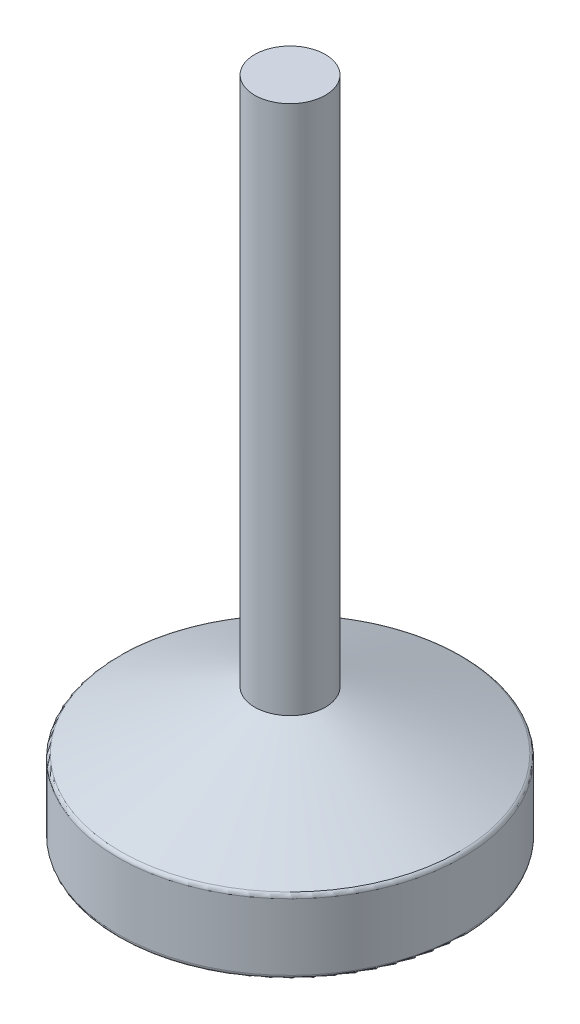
ISO-10303-21;
HEADER;
FILE_DESCRIPTION(('STEP AP214'),'2;1');
FILE_NAME('part.step','',(''),(''),'','','');
FILE_SCHEMA(('AUTOMOTIVE_DESIGN { 1 0 10303 214 1 1 1 1 }'));
ENDSEC;
DATA;
#1=APPLICATION_CONTEXT('core data for automotive mechanical design processes');
#2=APPLICATION_PROTOCOL_DEFINITION('international standard','automotive_design',2000,#1);
#3=PRODUCT_CONTEXT('',#1,'mechanical');
#4=PRODUCT('Part','Part','',(#3));
#5=PRODUCT_RELATED_PRODUCT_CATEGORY('part','',(#4));
#6=PRODUCT_DEFINITION_FORMATION('','',#4);
#7=PRODUCT_DEFINITION_CONTEXT('part definition',#1,'design');
#8=PRODUCT_DEFINITION('design','',#6,#7);
#9=PRODUCT_DEFINITION_SHAPE('','',#8);
#10=(LENGTH_UNIT() NAMED_UNIT(*) SI_UNIT(.MILLI.,.METRE.));
#11=(NAMED_UNIT(*) PLANE_ANGLE_UNIT() SI_UNIT($,.RADIAN.));
#12=(NAMED_UNIT(*) SI_UNIT($,.STERADIAN.) SOLID_ANGLE_UNIT());
#13=UNCERTAINTY_MEASURE_WITH_UNIT(LENGTH_MEASURE(1.E-05),#10,'distance_accuracy_value','');
#14=(GEOMETRIC_REPRESENTATION_CONTEXT(3) GLOBAL_UNCERTAINTY_ASSIGNED_CONTEXT((#13)) GLOBAL_UNIT_ASSIGNED_CONTEXT((#10,
#11,#12)) REPRESENTATION_CONTEXT('',''));
#15=CARTESIAN_POINT('',(0.,0.,0.));
#16=DIRECTION('',(0.,0.,1.));
#17=DIRECTION('',(1.,0.,0.));
#18=AXIS2_PLACEMENT_3D('',#15,#16,#17);
#19=CARTESIAN_POINT('',(8.00000000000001,0.,0.));
#20=DIRECTION('',(0.,-1.,0.));
#21=DIRECTION('',(0.,0.,-1.));
#22=AXIS2_PLACEMENT_3D('',#19,#20,#21);
#23=PLANE('',#22);
#24=CARTESIAN_POINT('',(0.,0.,0.));
#25=DIRECTION('',(0.,1.,0.));
#26=DIRECTION('',(0.,0.,1.));
#27=AXIS2_PLACEMENT_3D('',#24,#25,#26);
#28=CIRCLE('',#27,8.00000000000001);
#29=CARTESIAN_POINT('',(0.,0.,8.00000000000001));
#30=VERTEX_POINT('',#29);
#31=EDGE_CURVE('E54',#30,#30,#28,.T.);
#32=ORIENTED_EDGE('',*,*,#31,.T.);
#33=EDGE_LOOP('',(#32));
#34=FACE_BOUND('',#33,.T.);
#35=ADVANCED_FACE('F32',(#34),#23,.F.);
#36=CARTESIAN_POINT('',(0.,-150.,0.));
#37=DIRECTION('',(0.,1.,0.));
#38=DIRECTION('',(0.,0.,1.));
#39=AXIS2_PLACEMENT_3D('',#36,#37,#38);
#40=PLANE('',#39);
#41=CARTESIAN_POINT('',(0.,-150.,0.));
#42=DIRECTION('',(0.,1.,0.));
#43=DIRECTION('',(0.,0.,1.));
#44=AXIS2_PLACEMENT_3D('',#41,#42,#43);
#45=CIRCLE('',#44,37.9995484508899);
#46=CARTESIAN_POINT('',(0.,-150.,37.9995484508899));
#47=VERTEX_POINT('',#46);
#48=EDGE_CURVE('E10',#47,#47,#45,.T.);
#49=ORIENTED_EDGE('',*,*,#48,.F.);
#50=EDGE_LOOP('',(#49));
#51=FACE_BOUND('',#50,.T.);
#52=ADVANCED_FACE('F84',(#51),#40,.F.);
#53=CARTESIAN_POINT('',(0.,-149.,0.));
#54=DIRECTION('',(0.,1.,0.));
#55=DIRECTION('',(0.,0.,1.));
#56=AXIS2_PLACEMENT_3D('',#53,#54,#55);
#57=TOROIDAL_SURFACE('',#56,37.9995484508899,1.);
#58=CARTESIAN_POINT('',(0.,-149.,0.));
#59=DIRECTION('',(0.,1.,0.));
#60=DIRECTION('',(0.,0.,1.));
#61=AXIS2_PLACEMENT_3D('',#58,#59,#60);
#62=CIRCLE('',#61,38.9995484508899);
#63=CARTESIAN_POINT('',(0.,-149.,38.9995484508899));
#64=VERTEX_POINT('',#63);
#65=EDGE_CURVE('E38',#64,#64,#62,.T.);
#66=ORIENTED_EDGE('',*,*,#65,.F.);
#67=EDGE_LOOP('',(#66));
#68=FACE_BOUND('',#67,.T.);
#69=ORIENTED_EDGE('',*,*,#48,.T.);
#70=EDGE_LOOP('',(#69));
#71=FACE_BOUND('',#70,.T.);
#72=ADVANCED_FACE('F79',(#68,#71),#57,.T.);
#73=CARTESIAN_POINT('',(0.,10.3605900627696,0.));
#74=DIRECTION('',(0.,1.,0.));
#75=DIRECTION('',(0.,0.,1.));
#76=AXIS2_PLACEMENT_3D('',#73,#74,#75);
#77=CYLINDRICAL_SURFACE('',#76,38.9995484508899);
#78=CARTESIAN_POINT('',(0.,-134.,0.));
#79=DIRECTION('',(0.,1.,0.));
#80=DIRECTION('',(0.,0.,1.));
#81=AXIS2_PLACEMENT_3D('',#78,#79,#80);
#82=CIRCLE('',#81,38.9995484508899);
#83=CARTESIAN_POINT('',(0.,-134.,38.9995484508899));
#84=VERTEX_POINT('',#83);
#85=EDGE_CURVE('E42',#84,#84,#82,.T.);
#86=ORIENTED_EDGE('',*,*,#85,.F.);
#87=EDGE_LOOP('',(#86));
#88=FACE_BOUND('',#87,.T.);
#89=ORIENTED_EDGE('',*,*,#65,.T.);
#90=EDGE_LOOP('',(#89));
#91=FACE_BOUND('',#90,.T.);
#92=ADVANCED_FACE('F74',(#88,#91),#77,.T.);
#93=CARTESIAN_POINT('',(0.,-134.,0.));
#94=DIRECTION('',(0.,1.,0.));
#95=DIRECTION('',(0.,0.,1.));
#96=AXIS2_PLACEMENT_3D('',#93,#94,#95);
#97=TOROIDAL_SURFACE('',#96,37.9995484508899,1.00000000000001);
#98=CARTESIAN_POINT('',(0.,-133.08145876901,0.));
#99=DIRECTION('',(0.,1.,0.));
#100=DIRECTION('',(0.,0.,1.));
#101=AXIS2_PLACEMENT_3D('',#98,#99,#100);
#102=CIRCLE('',#101,38.3948736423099);
#103=CARTESIAN_POINT('',(0.,-133.08145876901,-38.3948736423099));
#104=VERTEX_POINT('',#103);
#105=EDGE_CURVE('E46',#104,#104,#102,.T.);
#106=ORIENTED_EDGE('',*,*,#105,.F.);
#107=EDGE_LOOP('',(#106));
#108=FACE_BOUND('',#107,.T.);
#109=ORIENTED_EDGE('',*,*,#85,.T.);
#110=EDGE_LOOP('',(#109));
#111=FACE_BOUND('',#110,.T.);
#112=ADVANCED_FACE('F68',(#108,#111),#97,.T.);
#113=CARTESIAN_POINT('',(0.,-133.08145876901,0.));
#114=DIRECTION('',(0.,-1.,0.));
#115=DIRECTION('',(0.,0.,-1.));
#116=AXIS2_PLACEMENT_3D('',#113,#114,#115);
#117=CONICAL_SURFACE('',#116,38.3948736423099,1.16437447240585);
#118=CARTESIAN_POINT('',(0.,-120.,0.));
#119=DIRECTION('',(0.,1.,0.));
#120=DIRECTION('',(0.,0.,1.));
#121=AXIS2_PLACEMENT_3D('',#118,#119,#120);
#122=CIRCLE('',#121,8.00000000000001);
#123=CARTESIAN_POINT('',(0.,-120.,-8.00000000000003));
#124=VERTEX_POINT('',#123);
#125=EDGE_CURVE('E51',#124,#124,#122,.T.);
#126=CARTESIAN_POINT('',(0.,-120.,-8.00000000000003));
#127=CARTESIAN_POINT('',(0.,-120.136265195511,-8.31661326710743));
#128=CARTESIAN_POINT('',(0.,-120.272530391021,-8.63322653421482));
#129=CARTESIAN_POINT('',(0.,-120.545060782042,-9.26645306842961));
#130=CARTESIAN_POINT('',(0.,-120.681325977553,-9.583066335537));
#131=CARTESIAN_POINT('',(0.,-120.953856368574,-10.2162928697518));
#132=CARTESIAN_POINT('',(0.,-121.090121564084,-10.5329061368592));
#133=CARTESIAN_POINT('',(0.,-121.362651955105,-11.166132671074));
#134=CARTESIAN_POINT('',(0.,-121.498917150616,-11.4827459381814));
#135=CARTESIAN_POINT('',(0.,-121.771447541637,-12.1159724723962));
#136=CARTESIAN_POINT('',(0.,-121.907712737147,-12.4325857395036));
#137=CARTESIAN_POINT('',(0.,-122.180243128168,-13.0658122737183));
#138=CARTESIAN_POINT('',(0.,-122.316508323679,-13.3824255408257));
#139=CARTESIAN_POINT('',(0.,-122.5890387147,-14.0156520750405));
#140=CARTESIAN_POINT('',(0.,-122.72530391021,-14.3322653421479));
#141=CARTESIAN_POINT('',(0.,-122.997834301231,-14.9654918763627));
#142=CARTESIAN_POINT('',(0.,-123.134099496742,-15.2821051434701));
#143=CARTESIAN_POINT('',(0.,-123.406629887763,-15.9153316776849));
#144=CARTESIAN_POINT('',(0.,-123.542895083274,-16.2319449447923));
#145=CARTESIAN_POINT('',(0.,-123.815425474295,-16.8651714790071));
#146=CARTESIAN_POINT('',(0.,-123.951690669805,-17.1817847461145));
#147=CARTESIAN_POINT('',(0.,-124.224221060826,-17.8150112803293));
#148=CARTESIAN_POINT('',(0.,-124.360486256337,-18.1316245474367));
#149=CARTESIAN_POINT('',(0.,-124.633016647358,-18.7648510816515));
#150=CARTESIAN_POINT('',(0.,-124.769281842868,-19.0814643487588));
#151=CARTESIAN_POINT('',(0.,-125.041812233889,-19.7146908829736));
#152=CARTESIAN_POINT('',(0.,-125.1780774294,-20.031304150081));
#153=CARTESIAN_POINT('',(0.,-125.450607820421,-20.6645306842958));
#154=CARTESIAN_POINT('',(0.,-125.586873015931,-20.9811439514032));
#155=CARTESIAN_POINT('',(0.,-125.859403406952,-21.614370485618));
#156=CARTESIAN_POINT('',(0.,-125.995668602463,-21.9309837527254));
#157=CARTESIAN_POINT('',(0.,-126.268198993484,-22.5642102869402));
#158=CARTESIAN_POINT('',(0.,-126.404464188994,-22.8808235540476));
#159=CARTESIAN_POINT('',(0.,-126.676994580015,-23.5140500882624));
#160=CARTESIAN_POINT('',(0.,-126.813259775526,-23.8306633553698));
#161=CARTESIAN_POINT('',(0.,-127.085790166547,-24.4638898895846));
#162=CARTESIAN_POINT('',(0.,-127.222055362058,-24.7805031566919));
#163=CARTESIAN_POINT('',(0.,-127.494585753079,-25.4137296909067));
#164=CARTESIAN_POINT('',(0.,-127.630850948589,-25.7303429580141));
#165=CARTESIAN_POINT('',(0.,-127.90338133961,-26.3635694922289));
#166=CARTESIAN_POINT('',(0.,-128.039646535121,-26.6801827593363));
#167=CARTESIAN_POINT('',(0.,-128.312176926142,-27.3134092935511));
#168=CARTESIAN_POINT('',(0.,-128.448442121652,-27.6300225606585));
#169=CARTESIAN_POINT('',(0.,-128.720972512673,-28.2632490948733));
#170=CARTESIAN_POINT('',(0.,-128.857237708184,-28.5798623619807));
#171=CARTESIAN_POINT('',(0.,-129.129768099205,-29.2130888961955));
#172=CARTESIAN_POINT('',(0.,-129.266033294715,-29.5297021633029));
#173=CARTESIAN_POINT('',(0.,-129.538563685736,-30.1629286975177));
#174=CARTESIAN_POINT('',(0.,-129.674828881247,-30.479541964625));
#175=CARTESIAN_POINT('',(0.,-129.947359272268,-31.1127684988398));
#176=CARTESIAN_POINT('',(0.,-130.083624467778,-31.4293817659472));
#177=CARTESIAN_POINT('',(0.,-130.3561548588,-32.062608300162));
#178=CARTESIAN_POINT('',(0.,-130.49242005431,-32.3792215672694));
#179=CARTESIAN_POINT('',(0.,-130.764950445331,-33.0124481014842));
#180=CARTESIAN_POINT('',(0.,-130.901215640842,-33.3290613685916));
#181=CARTESIAN_POINT('',(0.,-131.173746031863,-33.9622879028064));
#182=CARTESIAN_POINT('',(0.,-131.310011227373,-34.2789011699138));
#183=CARTESIAN_POINT('',(0.,-131.582541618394,-34.9121277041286));
#184=CARTESIAN_POINT('',(0.,-131.718806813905,-35.228740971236));
#185=CARTESIAN_POINT('',(0.,-131.991337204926,-35.8619675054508));
#186=CARTESIAN_POINT('',(0.,-132.127602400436,-36.1785807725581));
#187=CARTESIAN_POINT('',(0.,-132.400132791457,-36.8118073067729));
#188=CARTESIAN_POINT('',(0.,-132.536397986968,-37.1284205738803));
#189=CARTESIAN_POINT('',(0.,-132.808928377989,-37.7616471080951));
#190=CARTESIAN_POINT('',(0.,-132.945193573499,-38.0782603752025));
#191=CARTESIAN_POINT('',(0.,-133.08145876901,-38.3948736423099));
#192=B_SPLINE_CURVE_WITH_KNOTS('',3,(#126,#127,#128,#129,#130,#131,#132,#133,#134,#135,#136,
#137,#138,#139,#140,#141,#142,#143,#144,#145,#146,#147,#148,#149,#150,#151,#152,#153,#154,#155,
#156,#157,#158,#159,#160,#161,#162,#163,#164,#165,#166,#167,#168,#169,#170,#171,#172,#173,#174,
#175,#176,#177,#178,#179,#180,#181,#182,#183,#184,#185,#186,#187,#188,#189,#190,#191),
.UNSPECIFIED.,.F.,.F.,(4,2,2,2,2,2,2,2,2,2,2,2,2,2,2,2,2,2,2,2,2,2,2,2,2,2,2,2,2,2,2,2,4),(0.,
1.03407421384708,2.06814842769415,3.10222264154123,4.1362968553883,5.17037106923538,
6.20444528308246,7.23851949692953,8.27259371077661,9.30666792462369,10.3407421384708,
11.3748163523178,12.4088905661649,13.442964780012,14.4770389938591,15.5111132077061,
16.5451874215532,17.5792616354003,18.6133358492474,19.6474100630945,20.6814842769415,
21.7155584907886,22.7496327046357,23.7837069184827,24.8177811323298,25.8518553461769,
26.885929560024,27.920003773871,28.9540779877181,29.9881522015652,31.0222264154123,
32.0563006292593,33.0903748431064),.UNSPECIFIED.);
#193=EDGE_CURVE('BSEAM62',#124,#104,#192,.T.);
#194=ORIENTED_EDGE('',*,*,#125,.F.);
#195=ORIENTED_EDGE('',*,*,#105,.T.);
#196=ORIENTED_EDGE('',*,*,#193,.T.);
#197=ORIENTED_EDGE('',*,*,#193,.F.);
#198=EDGE_LOOP('',(#194,#196,#195,#197));
#199=FACE_BOUND('',#198,.T.);
#200=ADVANCED_FACE('F62',(#199),#117,.T.);
#201=CARTESIAN_POINT('',(0.,10.3605900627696,0.));
#202=DIRECTION('',(0.,1.,0.));
#203=DIRECTION('',(0.,0.,1.));
#204=AXIS2_PLACEMENT_3D('',#201,#202,#203);
#205=CYLINDRICAL_SURFACE('',#204,8.00000000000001);
#206=ORIENTED_EDGE('',*,*,#31,.F.);
#207=EDGE_LOOP('',(#206));
#208=FACE_BOUND('',#207,.T.);
#209=ORIENTED_EDGE('',*,*,#125,.T.);
#210=EDGE_LOOP('',(#209));
#211=FACE_BOUND('',#210,.T.);
#212=ADVANCED_FACE('F59',(#208,#211),#205,.T.);
#213=CLOSED_SHELL('',(#35,#52,#72,#92,#112,#200,#212));
#214=MANIFOLD_SOLID_BREP('B2',#213);
#215=ADVANCED_BREP_SHAPE_REPRESENTATION('',(#18,#214),#14);
#216=SHAPE_DEFINITION_REPRESENTATION(#9,#215);
ENDSEC;
END-ISO-10303-21;
